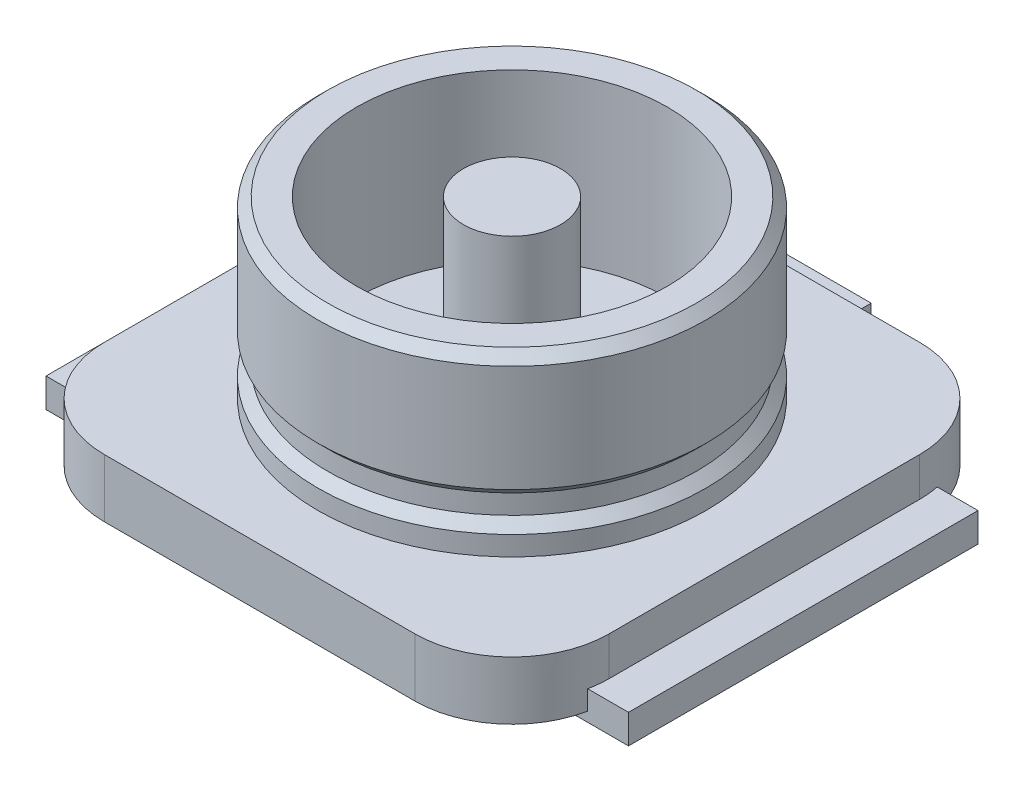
from build123d import *

# Parameters (mm, degrees)
EXTRUDE_START   = 0.05
EXTRUDE_1_DEPTH = 0.3
SKETCH_3_W      = 0.4
SKETCH_3_H      = 1.8
EXTRUDE_2_DEPTH = 0.15


with BuildPart() as part:
    # Sketch 1 → Extrude 1 (new body)
    with BuildSketch(Plane(origin=(0, 0, 0), x_dir=(1, 0, 0), z_dir=(0, 1, 0)).offset(EXTRUDE_START)):
        with BuildLine():
            Line((-0.8, -1.3), (0.8, -1.3))
            ThreePointArc((0.8, -1.3), (1.153553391, -1.153553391), (1.3, -0.8))
            Line((1.3, -0.8), (1.3, 0.8))
            ThreePointArc((1.3, 0.8), (1.153553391, 1.153553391), (0.8, 1.3))
            Line((0.8, 1.3), (-0.8, 1.3))
            ThreePointArc((-0.8, 1.3), (-1.153553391, 1.153553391), (-1.3, 0.8))
            Line((-1.3, 0.8), (-1.3, -0.8))
            ThreePointArc((-1.3, -0.8), (-1.153553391, -1.153553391), (-0.8, -1.3))
        make_face()
    extrude(amount=EXTRUDE_1_DEPTH)

    # Sketch 2 → Revolve 1 (revolve)
    with BuildSketch(Plane.XY, mode=Mode.PRIVATE) as revolve_1_sk:
        Polygon((0, 0.35), (1, 0.35), (1, 0.45), (0.95, 0.5), (0.95, 0.6), (1, 0.65), (1, 1.2), (0.95, 1.25), (0.8, 1.25), (0.8, 0.4), (0.25, 0.4), (0.25, 1.25), (0, 1.25), align=None)
    revolve(revolve_1_sk.sketch.rotate(Axis((0, 1.25, 0), (0, -1, 0)), 180), axis=Axis((0, 1.25, 0), (0, -1, 0)))

    # Sketch 3 → Extrude 2 (add)
    with BuildSketch(Plane(origin=(0, 0, 0), x_dir=(1, 0, 0), z_dir=(0, 1, 0))):
        with BuildLine():
            Line((-0.2, 0.346410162), (-0.2, 0.95))
            Line((-0.2, 0.95), (-0.3, 0.95))
            Line((-0.3, 0.95), (-0.3, 1.55))
            Line((-0.3, 1.55), (0.3, 1.55))
            Line((0.3, 1.55), (0.3, 0.95))
            Line((0.3, 0.95), (0.2, 0.95))
            Line((0.2, 0.95), (0.2, 0.346410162))
            ThreePointArc((0.2, 0.346410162), (0, -0.4), (-0.2, 0.346410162))
        make_face()
        with Locations((-1.3, 0)):
            Rectangle(SKETCH_3_W, SKETCH_3_H)
        with Locations((1.3, 0)):
            Rectangle(SKETCH_3_W, SKETCH_3_H)
    extrude(amount=EXTRUDE_2_DEPTH)


solid = part.part
